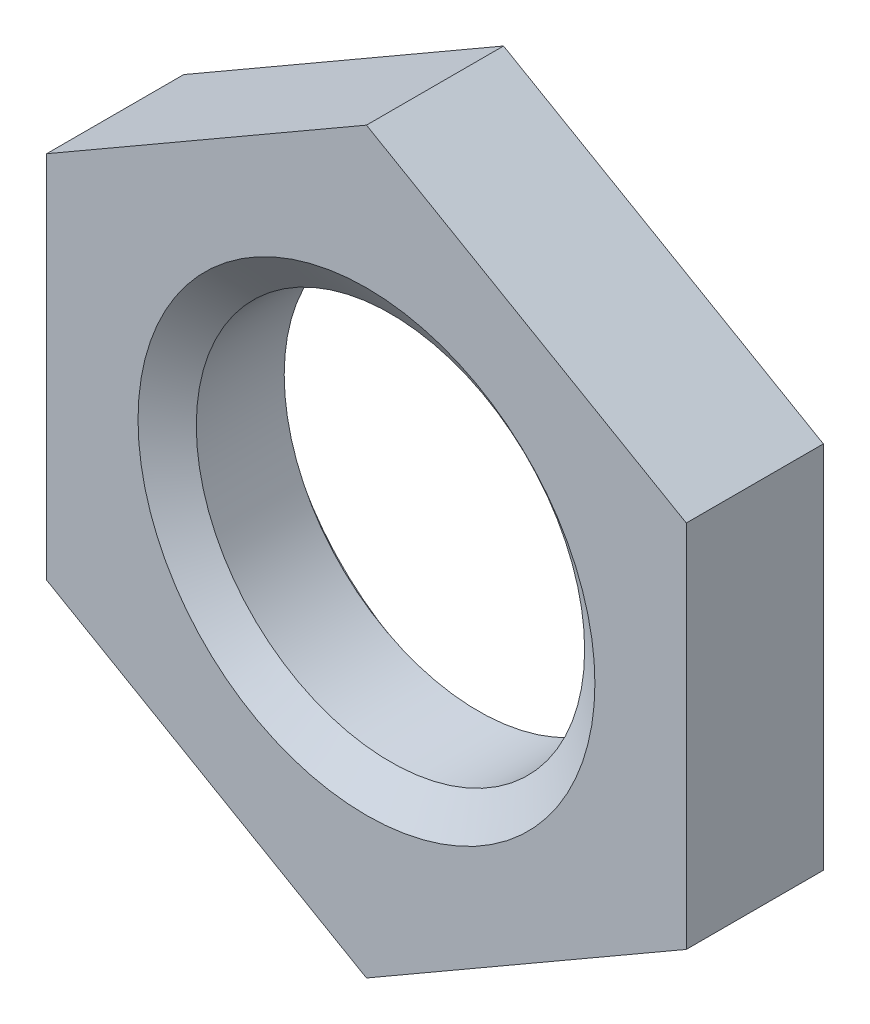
ISO-10303-21;
HEADER;
FILE_DESCRIPTION(('STEP AP214'),'2;1');
FILE_NAME('part.step','',(''),(''),'','','');
FILE_SCHEMA(('AUTOMOTIVE_DESIGN { 1 0 10303 214 1 1 1 1 }'));
ENDSEC;
DATA;
#1=APPLICATION_CONTEXT('core data for automotive mechanical design processes');
#2=APPLICATION_PROTOCOL_DEFINITION('international standard','automotive_design',2000,#1);
#3=PRODUCT_CONTEXT('',#1,'mechanical');
#4=PRODUCT('Part','Part','',(#3));
#5=PRODUCT_RELATED_PRODUCT_CATEGORY('part','',(#4));
#6=PRODUCT_DEFINITION_FORMATION('','',#4);
#7=PRODUCT_DEFINITION_CONTEXT('part definition',#1,'design');
#8=PRODUCT_DEFINITION('design','',#6,#7);
#9=PRODUCT_DEFINITION_SHAPE('','',#8);
#10=(LENGTH_UNIT() NAMED_UNIT(*) SI_UNIT(.MILLI.,.METRE.));
#11=(NAMED_UNIT(*) PLANE_ANGLE_UNIT() SI_UNIT($,.RADIAN.));
#12=(NAMED_UNIT(*) SI_UNIT($,.STERADIAN.) SOLID_ANGLE_UNIT());
#13=UNCERTAINTY_MEASURE_WITH_UNIT(LENGTH_MEASURE(1.E-05),#10,'distance_accuracy_value','');
#14=(GEOMETRIC_REPRESENTATION_CONTEXT(3) GLOBAL_UNCERTAINTY_ASSIGNED_CONTEXT((#13)) GLOBAL_UNIT_ASSIGNED_CONTEXT((#10,
#11,#12)) REPRESENTATION_CONTEXT('',''));
#15=CARTESIAN_POINT('',(0.,0.,0.));
#16=DIRECTION('',(0.,0.,1.));
#17=DIRECTION('',(1.,0.,0.));
#18=AXIS2_PLACEMENT_3D('',#15,#16,#17);
#19=CARTESIAN_POINT('',(0.,0.,-3.));
#20=DIRECTION('',(0.,0.,1.));
#21=DIRECTION('',(1.,0.,0.));
#22=AXIS2_PLACEMENT_3D('',#19,#20,#21);
#23=CYLINDRICAL_SURFACE('',#22,4.25);
#24=CARTESIAN_POINT('',(0.,0.,-0.525155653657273));
#25=DIRECTION('',(0.,0.,1.));
#26=DIRECTION('',(1.,0.,0.));
#27=AXIS2_PLACEMENT_3D('',#24,#25,#26);
#28=CIRCLE('',#27,4.25);
#29=CARTESIAN_POINT('',(4.25,0.,-0.525155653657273));
#30=VERTEX_POINT('',#29);
#31=EDGE_CURVE('E111',#30,#30,#28,.F.);
#32=ORIENTED_EDGE('',*,*,#31,.F.);
#33=EDGE_LOOP('',(#32));
#34=FACE_BOUND('',#33,.T.);
#35=CARTESIAN_POINT('',(0.,0.,-2.44944434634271));
#36=DIRECTION('',(0.,0.,-1.));
#37=DIRECTION('',(-1.,0.,0.));
#38=AXIS2_PLACEMENT_3D('',#35,#36,#37);
#39=CIRCLE('',#38,4.25);
#40=CARTESIAN_POINT('',(-4.25,0.,-2.44944434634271));
#41=VERTEX_POINT('',#40);
#42=EDGE_CURVE('E40',#41,#41,#39,.F.);
#43=ORIENTED_EDGE('',*,*,#42,.F.);
#44=EDGE_LOOP('',(#43));
#45=FACE_BOUND('',#44,.T.);
#46=ADVANCED_FACE('F36',(#34,#45),#23,.F.);
#47=CARTESIAN_POINT('',(0.,8.08290376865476,-3.));
#48=DIRECTION('',(0.,0.,-1.));
#49=DIRECTION('',(-1.,0.,0.));
#50=AXIS2_PLACEMENT_3D('',#47,#48,#49);
#51=PLANE('',#50);
#52=DIRECTION('',(-0.866025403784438,-0.500000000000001,0.));
#53=VECTOR('',#52,1.);
#54=CARTESIAN_POINT('',(0.,8.08290376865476,-3.));
#55=LINE('',#54,#53);
#56=CARTESIAN_POINT('',(0.,8.08290376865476,-3.));
#57=VERTEX_POINT('',#56);
#58=CARTESIAN_POINT('',(-7.,4.04145188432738,-3.));
#59=VERTEX_POINT('',#58);
#60=EDGE_CURVE('E92',#57,#59,#55,.T.);
#61=ORIENTED_EDGE('',*,*,#60,.F.);
#62=DIRECTION('',(-0.866025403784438,0.500000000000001,0.));
#63=VECTOR('',#62,1.);
#64=CARTESIAN_POINT('',(7.,4.04145188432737,-3.));
#65=LINE('',#64,#63);
#66=CARTESIAN_POINT('',(7.,4.04145188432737,-3.));
#67=VERTEX_POINT('',#66);
#68=EDGE_CURVE('E97',#67,#57,#65,.T.);
#69=ORIENTED_EDGE('',*,*,#68,.F.);
#70=DIRECTION('',(0.,-1.,0.));
#71=VECTOR('',#70,1.);
#72=CARTESIAN_POINT('',(7.,4.04145188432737,-3.));
#73=LINE('',#72,#71);
#74=CARTESIAN_POINT('',(7.,-4.04145188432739,-3.));
#75=VERTEX_POINT('',#74);
#76=EDGE_CURVE('E136',#67,#75,#73,.T.);
#77=ORIENTED_EDGE('',*,*,#76,.T.);
#78=DIRECTION('',(0.866025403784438,0.500000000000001,0.));
#79=VECTOR('',#78,1.);
#80=CARTESIAN_POINT('',(0.,-8.08290376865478,-3.));
#81=LINE('',#80,#79);
#82=CARTESIAN_POINT('',(0.,-8.08290376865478,-3.));
#83=VERTEX_POINT('',#82);
#84=EDGE_CURVE('E133',#83,#75,#81,.T.);
#85=ORIENTED_EDGE('',*,*,#84,.F.);
#86=DIRECTION('',(0.866025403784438,-0.500000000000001,0.));
#87=VECTOR('',#86,1.);
#88=CARTESIAN_POINT('',(-7.,-4.04145188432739,-3.));
#89=LINE('',#88,#87);
#90=CARTESIAN_POINT('',(-7.,-4.04145188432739,-3.));
#91=VERTEX_POINT('',#90);
#92=EDGE_CURVE('E130',#91,#83,#89,.T.);
#93=ORIENTED_EDGE('',*,*,#92,.F.);
#94=DIRECTION('',(0.,-1.,0.));
#95=VECTOR('',#94,1.);
#96=CARTESIAN_POINT('',(-7.,4.04145188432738,-3.));
#97=LINE('',#96,#95);
#98=EDGE_CURVE('E128',#59,#91,#97,.T.);
#99=ORIENTED_EDGE('',*,*,#98,.F.);
#100=EDGE_LOOP('',(#61,#69,#77,#85,#93,#99));
#101=FACE_BOUND('',#100,.T.);
#102=CARTESIAN_POINT('',(0.,0.,-3.));
#103=DIRECTION('',(0.,0.,-1.));
#104=DIRECTION('',(-1.,0.,0.));
#105=AXIS2_PLACEMENT_3D('',#102,#103,#104);
#106=CIRCLE('',#105,5.);
#107=CARTESIAN_POINT('',(-5.,0.,-3.));
#108=VERTEX_POINT('',#107);
#109=EDGE_CURVE('E144',#108,#108,#106,.F.);
#110=ORIENTED_EDGE('',*,*,#109,.T.);
#111=EDGE_LOOP('',(#110));
#112=FACE_BOUND('',#111,.T.);
#113=ADVANCED_FACE('F163',(#101,#112),#51,.T.);
#114=CARTESIAN_POINT('',(0.,8.08290376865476,0.));
#115=DIRECTION('',(0.,0.,-1.));
#116=DIRECTION('',(-1.,0.,0.));
#117=AXIS2_PLACEMENT_3D('',#114,#115,#116);
#118=PLANE('',#117);
#119=DIRECTION('',(-0.866025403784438,-0.500000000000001,0.));
#120=VECTOR('',#119,1.);
#121=CARTESIAN_POINT('',(0.,8.08290376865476,0.));
#122=LINE('',#121,#120);
#123=CARTESIAN_POINT('',(0.,8.08290376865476,0.));
#124=VERTEX_POINT('',#123);
#125=CARTESIAN_POINT('',(-7.,4.04145188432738,0.));
#126=VERTEX_POINT('',#125);
#127=EDGE_CURVE('E90',#124,#126,#122,.T.);
#128=ORIENTED_EDGE('',*,*,#127,.T.);
#129=DIRECTION('',(0.,-1.,0.));
#130=VECTOR('',#129,1.);
#131=CARTESIAN_POINT('',(-7.,4.04145188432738,0.));
#132=LINE('',#131,#130);
#133=CARTESIAN_POINT('',(-7.,-4.04145188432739,0.));
#134=VERTEX_POINT('',#133);
#135=EDGE_CURVE('E100',#126,#134,#132,.T.);
#136=ORIENTED_EDGE('',*,*,#135,.T.);
#137=DIRECTION('',(0.866025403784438,-0.500000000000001,0.));
#138=VECTOR('',#137,1.);
#139=CARTESIAN_POINT('',(-7.,-4.04145188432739,0.));
#140=LINE('',#139,#138);
#141=CARTESIAN_POINT('',(0.,-8.08290376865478,0.));
#142=VERTEX_POINT('',#141);
#143=EDGE_CURVE('E105',#134,#142,#140,.T.);
#144=ORIENTED_EDGE('',*,*,#143,.T.);
#145=DIRECTION('',(0.866025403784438,0.500000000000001,0.));
#146=VECTOR('',#145,1.);
#147=CARTESIAN_POINT('',(0.,-8.08290376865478,0.));
#148=LINE('',#147,#146);
#149=CARTESIAN_POINT('',(7.,-4.04145188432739,0.));
#150=VERTEX_POINT('',#149);
#151=EDGE_CURVE('E120',#142,#150,#148,.T.);
#152=ORIENTED_EDGE('',*,*,#151,.T.);
#153=DIRECTION('',(0.,-1.,0.));
#154=VECTOR('',#153,1.);
#155=CARTESIAN_POINT('',(7.,4.04145188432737,0.));
#156=LINE('',#155,#154);
#157=CARTESIAN_POINT('',(7.,4.04145188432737,0.));
#158=VERTEX_POINT('',#157);
#159=EDGE_CURVE('E123',#158,#150,#156,.T.);
#160=ORIENTED_EDGE('',*,*,#159,.F.);
#161=DIRECTION('',(-0.866025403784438,0.500000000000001,0.));
#162=VECTOR('',#161,1.);
#163=CARTESIAN_POINT('',(7.,4.04145188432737,0.));
#164=LINE('',#163,#162);
#165=EDGE_CURVE('E110',#158,#124,#164,.T.);
#166=ORIENTED_EDGE('',*,*,#165,.T.);
#167=EDGE_LOOP('',(#128,#136,#144,#152,#160,#166));
#168=FACE_BOUND('',#167,.T.);
#169=CARTESIAN_POINT('',(0.,0.,0.));
#170=DIRECTION('',(0.,0.,1.));
#171=DIRECTION('',(1.,0.,0.));
#172=AXIS2_PLACEMENT_3D('',#169,#170,#171);
#173=CIRCLE('',#172,5.);
#174=CARTESIAN_POINT('',(5.,0.,0.));
#175=VERTEX_POINT('',#174);
#176=EDGE_CURVE('E114',#175,#175,#173,.T.);
#177=ORIENTED_EDGE('',*,*,#176,.F.);
#178=EDGE_LOOP('',(#177));
#179=FACE_BOUND('',#178,.T.);
#180=ADVANCED_FACE('F107',(#168,#179),#118,.F.);
#181=CARTESIAN_POINT('',(0.,8.08290376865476,-3.));
#182=DIRECTION('',(-0.500000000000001,0.866025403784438,0.));
#183=DIRECTION('',(-0.866025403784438,-0.500000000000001,0.));
#184=AXIS2_PLACEMENT_3D('',#181,#182,#183);
#185=PLANE('',#184);
#186=ORIENTED_EDGE('',*,*,#127,.F.);
#187=DIRECTION('',(0.,0.,1.));
#188=VECTOR('',#187,1.);
#189=CARTESIAN_POINT('',(0.,8.08290376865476,-3.));
#190=LINE('',#189,#188);
#191=EDGE_CURVE('E11',#57,#124,#190,.T.);
#192=ORIENTED_EDGE('',*,*,#191,.F.);
#193=ORIENTED_EDGE('',*,*,#60,.T.);
#194=DIRECTION('',(0.,0.,1.));
#195=VECTOR('',#194,1.);
#196=CARTESIAN_POINT('',(-7.,4.04145188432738,-3.));
#197=LINE('',#196,#195);
#198=EDGE_CURVE('E87',#59,#126,#197,.T.);
#199=ORIENTED_EDGE('',*,*,#198,.T.);
#200=EDGE_LOOP('',(#186,#192,#193,#199));
#201=FACE_BOUND('',#200,.T.);
#202=ADVANCED_FACE('F38',(#201),#185,.T.);
#203=CARTESIAN_POINT('',(7.,4.04145188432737,-3.));
#204=DIRECTION('',(0.500000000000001,0.866025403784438,0.));
#205=DIRECTION('',(-0.866025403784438,0.500000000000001,0.));
#206=AXIS2_PLACEMENT_3D('',#203,#204,#205);
#207=PLANE('',#206);
#208=ORIENTED_EDGE('',*,*,#165,.F.);
#209=DIRECTION('',(0.,0.,1.));
#210=VECTOR('',#209,1.);
#211=CARTESIAN_POINT('',(7.,4.04145188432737,-3.));
#212=LINE('',#211,#210);
#213=EDGE_CURVE('E45',#67,#158,#212,.T.);
#214=ORIENTED_EDGE('',*,*,#213,.F.);
#215=ORIENTED_EDGE('',*,*,#68,.T.);
#216=ORIENTED_EDGE('',*,*,#191,.T.);
#217=EDGE_LOOP('',(#208,#214,#215,#216));
#218=FACE_BOUND('',#217,.T.);
#219=ADVANCED_FACE('F177',(#218),#207,.T.);
#220=CARTESIAN_POINT('',(7.,4.04145188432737,-3.));
#221=DIRECTION('',(-1.,0.,0.));
#222=DIRECTION('',(0.,0.,1.));
#223=AXIS2_PLACEMENT_3D('',#220,#221,#222);
#224=PLANE('',#223);
#225=ORIENTED_EDGE('',*,*,#159,.T.);
#226=DIRECTION('',(0.,0.,1.));
#227=VECTOR('',#226,1.);
#228=CARTESIAN_POINT('',(7.,-4.04145188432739,-3.));
#229=LINE('',#228,#227);
#230=EDGE_CURVE('E140',#75,#150,#229,.T.);
#231=ORIENTED_EDGE('',*,*,#230,.F.);
#232=ORIENTED_EDGE('',*,*,#76,.F.);
#233=ORIENTED_EDGE('',*,*,#213,.T.);
#234=EDGE_LOOP('',(#225,#231,#232,#233));
#235=FACE_BOUND('',#234,.T.);
#236=ADVANCED_FACE('F180',(#235),#224,.F.);
#237=CARTESIAN_POINT('',(0.,-8.08290376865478,-3.));
#238=DIRECTION('',(0.500000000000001,-0.866025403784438,0.));
#239=DIRECTION('',(0.866025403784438,0.500000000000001,0.));
#240=AXIS2_PLACEMENT_3D('',#237,#238,#239);
#241=PLANE('',#240);
#242=ORIENTED_EDGE('',*,*,#151,.F.);
#243=DIRECTION('',(0.,0.,1.));
#244=VECTOR('',#243,1.);
#245=CARTESIAN_POINT('',(0.,-8.08290376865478,-3.));
#246=LINE('',#245,#244);
#247=EDGE_CURVE('E142',#83,#142,#246,.T.);
#248=ORIENTED_EDGE('',*,*,#247,.F.);
#249=ORIENTED_EDGE('',*,*,#84,.T.);
#250=ORIENTED_EDGE('',*,*,#230,.T.);
#251=EDGE_LOOP('',(#242,#248,#249,#250));
#252=FACE_BOUND('',#251,.T.);
#253=ADVANCED_FACE('F183',(#252),#241,.T.);
#254=CARTESIAN_POINT('',(-7.,-4.04145188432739,-3.));
#255=DIRECTION('',(-0.500000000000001,-0.866025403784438,0.));
#256=DIRECTION('',(0.866025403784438,-0.500000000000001,0.));
#257=AXIS2_PLACEMENT_3D('',#254,#255,#256);
#258=PLANE('',#257);
#259=ORIENTED_EDGE('',*,*,#143,.F.);
#260=DIRECTION('',(0.,0.,1.));
#261=VECTOR('',#260,1.);
#262=CARTESIAN_POINT('',(-7.,-4.04145188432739,-3.));
#263=LINE('',#262,#261);
#264=EDGE_CURVE('E96',#91,#134,#263,.T.);
#265=ORIENTED_EDGE('',*,*,#264,.F.);
#266=ORIENTED_EDGE('',*,*,#92,.T.);
#267=ORIENTED_EDGE('',*,*,#247,.T.);
#268=EDGE_LOOP('',(#259,#265,#266,#267));
#269=FACE_BOUND('',#268,.T.);
#270=ADVANCED_FACE('F187',(#269),#258,.T.);
#271=CARTESIAN_POINT('',(-7.,4.04145188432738,-3.));
#272=DIRECTION('',(-1.,0.,0.));
#273=DIRECTION('',(0.,0.,1.));
#274=AXIS2_PLACEMENT_3D('',#271,#272,#273);
#275=PLANE('',#274);
#276=ORIENTED_EDGE('',*,*,#135,.F.);
#277=ORIENTED_EDGE('',*,*,#198,.F.);
#278=ORIENTED_EDGE('',*,*,#98,.T.);
#279=ORIENTED_EDGE('',*,*,#264,.T.);
#280=EDGE_LOOP('',(#276,#277,#278,#279));
#281=FACE_BOUND('',#280,.T.);
#282=ADVANCED_FACE('F101',(#281),#275,.T.);
#283=CARTESIAN_POINT('',(0.,0.,-0.577671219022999));
#284=DIRECTION('',(0.,0.,1.));
#285=DIRECTION('',(1.,0.,0.));
#286=AXIS2_PLACEMENT_3D('',#283,#284,#285);
#287=CONICAL_SURFACE('',#286,4.175,0.959931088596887);
#288=ORIENTED_EDGE('',*,*,#176,.T.);
#289=EDGE_LOOP('',(#288));
#290=FACE_BOUND('',#289,.T.);
#291=ORIENTED_EDGE('',*,*,#31,.T.);
#292=EDGE_LOOP('',(#291));
#293=FACE_BOUND('',#292,.T.);
#294=ADVANCED_FACE('F158',(#290,#293),#287,.F.);
#295=CARTESIAN_POINT('',(0.,0.,-2.9746));
#296=DIRECTION('',(0.,0.,-1.));
#297=DIRECTION('',(-1.,0.,0.));
#298=AXIS2_PLACEMENT_3D('',#295,#296,#297);
#299=CONICAL_SURFACE('',#298,5.,0.959931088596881);
#300=CARTESIAN_POINT('',(0.,0.,-2.9746));
#301=DIRECTION('',(0.,0.,1.));
#302=DIRECTION('',(1.,0.,0.));
#303=AXIS2_PLACEMENT_3D('',#300,#301,#302);
#304=CIRCLE('',#303,5.);
#305=CARTESIAN_POINT('',(5.,0.,-2.9746));
#306=VERTEX_POINT('',#305);
#307=EDGE_CURVE('E146',#306,#306,#304,.T.);
#308=ORIENTED_EDGE('',*,*,#307,.F.);
#309=EDGE_LOOP('',(#308));
#310=FACE_BOUND('',#309,.T.);
#311=ORIENTED_EDGE('',*,*,#42,.T.);
#312=EDGE_LOOP('',(#311));
#313=FACE_BOUND('',#312,.T.);
#314=ADVANCED_FACE('F155',(#310,#313),#299,.F.);
#315=CARTESIAN_POINT('',(0.,0.,-25.0375057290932));
#316=DIRECTION('',(0.,0.,1.));
#317=DIRECTION('',(1.,0.,0.));
#318=AXIS2_PLACEMENT_3D('',#315,#316,#317);
#319=CYLINDRICAL_SURFACE('',#318,5.);
#320=ORIENTED_EDGE('',*,*,#109,.F.);
#321=EDGE_LOOP('',(#320));
#322=FACE_BOUND('',#321,.T.);
#323=ORIENTED_EDGE('',*,*,#307,.T.);
#324=EDGE_LOOP('',(#323));
#325=FACE_BOUND('',#324,.T.);
#326=ADVANCED_FACE('F153',(#322,#325),#319,.F.);
#327=CLOSED_SHELL('',(#46,#113,#180,#202,#219,#236,#253,#270,#282,#294,#314,#326));
#328=MANIFOLD_SOLID_BREP('B2',#327);
#329=ADVANCED_BREP_SHAPE_REPRESENTATION('',(#18,#328),#14);
#330=SHAPE_DEFINITION_REPRESENTATION(#9,#329);
ENDSEC;
END-ISO-10303-21;
